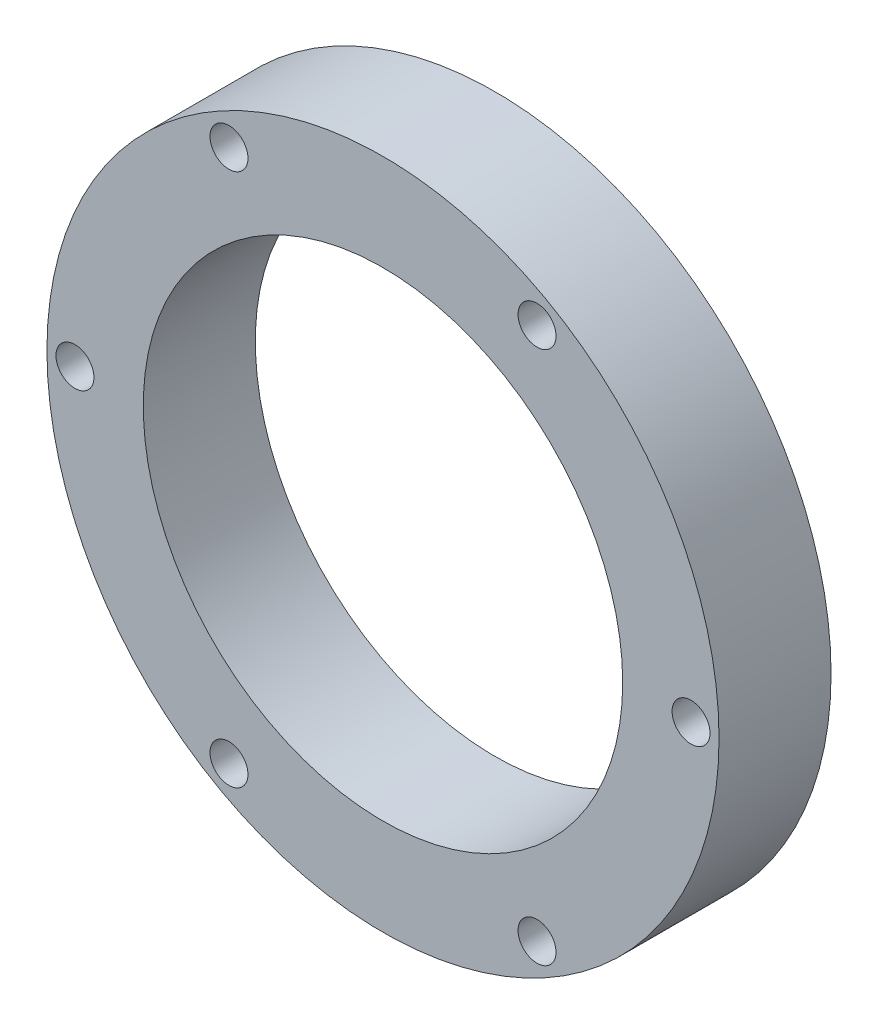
from build123d import *

# Parameters (mm, degrees)
SKETCH1_R                    = 38.1
SKETCH1_R_2                  = 27.178
BOSS_EXTRUDE1_DEPTH          = 12.7
F_18_0_1695_DIAMETER_HOLE1_D = 4.3053
SKETCH5_R                    = 31.8008
SKETCH5_R_2                  = 29.1592
CUT_EXTRUDE1_DEPTH           = 1.3208


with BuildPart() as part:
    # Sketch1 → Boss-Extrude1 (new body)
    with BuildSketch(Plane.XY):
        Circle(SKETCH1_R)
        Circle(SKETCH1_R_2, mode=Mode.SUBTRACT)
    extrude(amount=BOSS_EXTRUDE1_DEPTH)

    # 18 _0.1695_ Diameter Hole1 (through all)
    with Locations(Plane.XY.offset(12.7)):
        with Locations((-34.925, 0), (-17.4625, 30.245937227), (17.4625, 30.245937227), (34.925, 0), (17.4625, -30.245937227), (-17.4625, -30.245937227)):
            Hole(F_18_0_1695_DIAMETER_HOLE1_D / 2)

    # Sketch5 → Cut-Extrude1 (cut)
    with BuildSketch(Plane(origin=(0, 0, 0), x_dir=(-1, 0, 0), z_dir=(0, 0, -1))):
        Circle(SKETCH5_R)
        Circle(SKETCH5_R_2, mode=Mode.SUBTRACT)
    extrude(amount=-CUT_EXTRUDE1_DEPTH, mode=Mode.SUBTRACT)


solid = part.part
